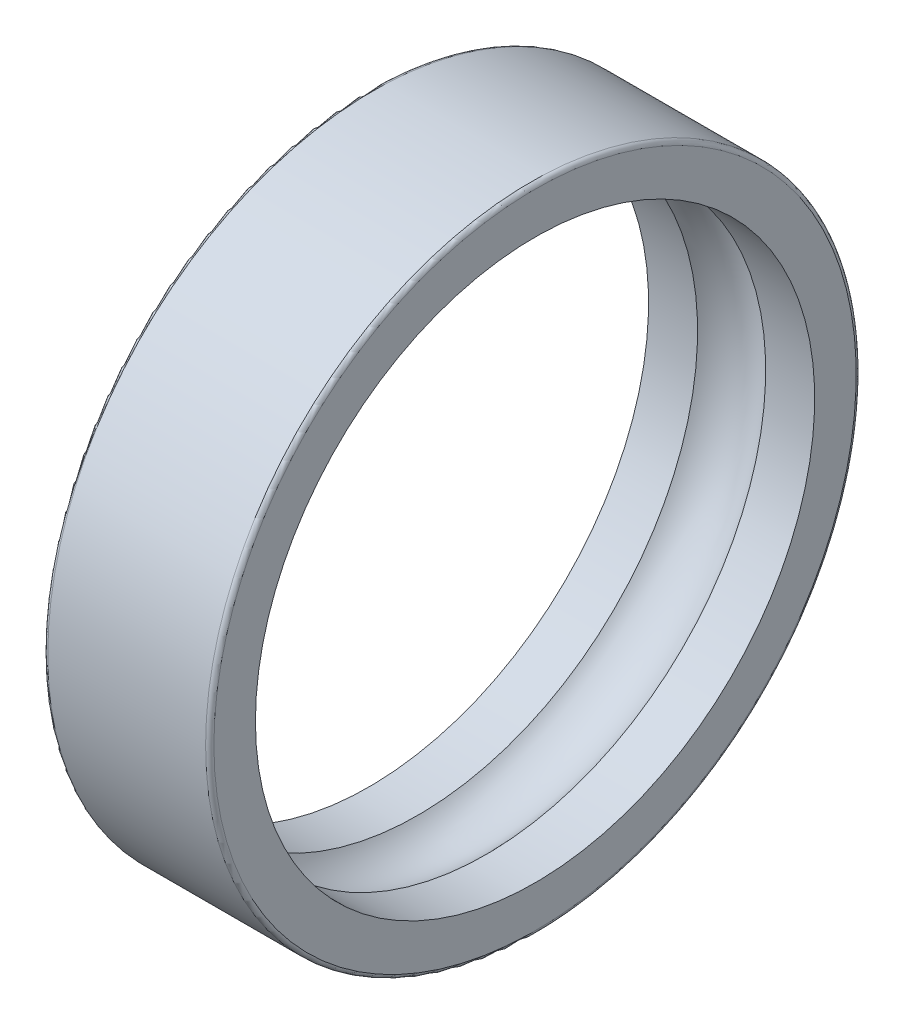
ISO-10303-21;
HEADER;
FILE_DESCRIPTION(('STEP AP214'),'2;1');
FILE_NAME('part.step','',(''),(''),'','','');
FILE_SCHEMA(('AUTOMOTIVE_DESIGN { 1 0 10303 214 1 1 1 1 }'));
ENDSEC;
DATA;
#1=APPLICATION_CONTEXT('core data for automotive mechanical design processes');
#2=APPLICATION_PROTOCOL_DEFINITION('international standard','automotive_design',2000,#1);
#3=PRODUCT_CONTEXT('',#1,'mechanical');
#4=PRODUCT('Part','Part','',(#3));
#5=PRODUCT_RELATED_PRODUCT_CATEGORY('part','',(#4));
#6=PRODUCT_DEFINITION_FORMATION('','',#4);
#7=PRODUCT_DEFINITION_CONTEXT('part definition',#1,'design');
#8=PRODUCT_DEFINITION('design','',#6,#7);
#9=PRODUCT_DEFINITION_SHAPE('','',#8);
#10=(LENGTH_UNIT() NAMED_UNIT(*) SI_UNIT(.MILLI.,.METRE.));
#11=(NAMED_UNIT(*) PLANE_ANGLE_UNIT() SI_UNIT($,.RADIAN.));
#12=(NAMED_UNIT(*) SI_UNIT($,.STERADIAN.) SOLID_ANGLE_UNIT());
#13=UNCERTAINTY_MEASURE_WITH_UNIT(LENGTH_MEASURE(1.E-05),#10,'distance_accuracy_value','');
#14=(GEOMETRIC_REPRESENTATION_CONTEXT(3) GLOBAL_UNCERTAINTY_ASSIGNED_CONTEXT((#13)) GLOBAL_UNIT_ASSIGNED_CONTEXT((#10,
#11,#12)) REPRESENTATION_CONTEXT('',''));
#15=CARTESIAN_POINT('',(0.,0.,0.));
#16=DIRECTION('',(0.,0.,1.));
#17=DIRECTION('',(1.,0.,0.));
#18=AXIS2_PLACEMENT_3D('',#15,#16,#17);
#19=CARTESIAN_POINT('',(0.299999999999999,0.,0.));
#20=DIRECTION('',(-1.,0.,0.));
#21=DIRECTION('',(0.,0.,1.));
#22=AXIS2_PLACEMENT_3D('',#19,#20,#21);
#23=TOROIDAL_SURFACE('',#22,23.2,0.300000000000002);
#24=CARTESIAN_POINT('',(0.,0.,0.));
#25=DIRECTION('',(-1.,0.,0.));
#26=DIRECTION('',(0.,0.,1.));
#27=AXIS2_PLACEMENT_3D('',#24,#25,#26);
#28=CIRCLE('',#27,23.2);
#29=CARTESIAN_POINT('',(0.,0.,23.2));
#30=VERTEX_POINT('',#29);
#31=EDGE_CURVE('E10',#30,#30,#28,.T.);
#32=ORIENTED_EDGE('',*,*,#31,.F.);
#33=EDGE_LOOP('',(#32));
#34=FACE_BOUND('',#33,.T.);
#35=CARTESIAN_POINT('',(0.299999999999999,0.,0.));
#36=DIRECTION('',(-1.,0.,0.));
#37=DIRECTION('',(0.,0.,1.));
#38=AXIS2_PLACEMENT_3D('',#35,#36,#37);
#39=CIRCLE('',#38,23.5);
#40=CARTESIAN_POINT('',(0.299999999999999,0.,23.5));
#41=VERTEX_POINT('',#40);
#42=EDGE_CURVE('E66',#41,#41,#39,.T.);
#43=ORIENTED_EDGE('',*,*,#42,.T.);
#44=EDGE_LOOP('',(#43));
#45=FACE_BOUND('',#44,.T.);
#46=ADVANCED_FACE('F38',(#34,#45),#23,.T.);
#47=CARTESIAN_POINT('',(0.,0.,-23.2));
#48=DIRECTION('',(1.,0.,0.));
#49=DIRECTION('',(0.,0.,-1.));
#50=AXIS2_PLACEMENT_3D('',#47,#48,#49);
#51=PLANE('',#50);
#52=CARTESIAN_POINT('',(0.,0.,0.));
#53=DIRECTION('',(-1.,0.,0.));
#54=DIRECTION('',(0.,0.,1.));
#55=AXIS2_PLACEMENT_3D('',#52,#53,#54);
#56=CIRCLE('',#55,20.2);
#57=CARTESIAN_POINT('',(0.,0.,20.2));
#58=VERTEX_POINT('',#57);
#59=EDGE_CURVE('E44',#58,#58,#56,.T.);
#60=ORIENTED_EDGE('',*,*,#59,.F.);
#61=EDGE_LOOP('',(#60));
#62=FACE_BOUND('',#61,.T.);
#63=ORIENTED_EDGE('',*,*,#31,.T.);
#64=EDGE_LOOP('',(#63));
#65=FACE_BOUND('',#64,.T.);
#66=ADVANCED_FACE('F103',(#62,#65),#51,.F.);
#67=CARTESIAN_POINT('',(0.,0.,0.));
#68=DIRECTION('',(-1.,0.,0.));
#69=DIRECTION('',(0.,0.,1.));
#70=AXIS2_PLACEMENT_3D('',#67,#68,#69);
#71=CYLINDRICAL_SURFACE('',#70,20.2);
#72=CARTESIAN_POINT('',(3.54032522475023,0.,0.));
#73=DIRECTION('',(-1.,0.,0.));
#74=DIRECTION('',(0.,0.,1.));
#75=AXIS2_PLACEMENT_3D('',#72,#73,#74);
#76=CIRCLE('',#75,20.2);
#77=CARTESIAN_POINT('',(3.54032522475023,0.,20.2));
#78=VERTEX_POINT('',#77);
#79=EDGE_CURVE('E48',#78,#78,#76,.T.);
#80=ORIENTED_EDGE('',*,*,#79,.F.);
#81=EDGE_LOOP('',(#80));
#82=FACE_BOUND('',#81,.T.);
#83=ORIENTED_EDGE('',*,*,#59,.T.);
#84=EDGE_LOOP('',(#83));
#85=FACE_BOUND('',#84,.T.);
#86=ADVANCED_FACE('F98',(#82,#85),#71,.F.);
#87=CARTESIAN_POINT('',(6.,0.,0.));
#88=DIRECTION('',(-1.,0.,0.));
#89=DIRECTION('',(0.,0.,1.));
#90=AXIS2_PLACEMENT_3D('',#87,#88,#89);
#91=TOROIDAL_SURFACE('',#90,18.,3.3);
#92=CARTESIAN_POINT('',(8.45967477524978,0.,0.));
#93=DIRECTION('',(-1.,0.,0.));
#94=DIRECTION('',(0.,0.,1.));
#95=AXIS2_PLACEMENT_3D('',#92,#93,#94);
#96=CIRCLE('',#95,20.2);
#97=CARTESIAN_POINT('',(8.45967477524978,0.,20.2));
#98=VERTEX_POINT('',#97);
#99=EDGE_CURVE('E52',#98,#98,#96,.T.);
#100=ORIENTED_EDGE('',*,*,#99,.F.);
#101=EDGE_LOOP('',(#100));
#102=FACE_BOUND('',#101,.T.);
#103=ORIENTED_EDGE('',*,*,#79,.T.);
#104=EDGE_LOOP('',(#103));
#105=FACE_BOUND('',#104,.T.);
#106=ADVANCED_FACE('F92',(#102,#105),#91,.F.);
#107=CARTESIAN_POINT('',(0.,0.,0.));
#108=DIRECTION('',(-1.,0.,0.));
#109=DIRECTION('',(0.,0.,1.));
#110=AXIS2_PLACEMENT_3D('',#107,#108,#109);
#111=CYLINDRICAL_SURFACE('',#110,20.2);
#112=CARTESIAN_POINT('',(12.,0.,0.));
#113=DIRECTION('',(-1.,0.,0.));
#114=DIRECTION('',(0.,0.,1.));
#115=AXIS2_PLACEMENT_3D('',#112,#113,#114);
#116=CIRCLE('',#115,20.2);
#117=CARTESIAN_POINT('',(12.,0.,20.2));
#118=VERTEX_POINT('',#117);
#119=EDGE_CURVE('E57',#118,#118,#116,.T.);
#120=ORIENTED_EDGE('',*,*,#119,.F.);
#121=EDGE_LOOP('',(#120));
#122=FACE_BOUND('',#121,.T.);
#123=ORIENTED_EDGE('',*,*,#99,.T.);
#124=EDGE_LOOP('',(#123));
#125=FACE_BOUND('',#124,.T.);
#126=ADVANCED_FACE('F86',(#122,#125),#111,.F.);
#127=CARTESIAN_POINT('',(12.,0.,-23.2));
#128=DIRECTION('',(-1.,0.,0.));
#129=DIRECTION('',(0.,0.,1.));
#130=AXIS2_PLACEMENT_3D('',#127,#128,#129);
#131=PLANE('',#130);
#132=CARTESIAN_POINT('',(12.,0.,0.));
#133=DIRECTION('',(-1.,0.,0.));
#134=DIRECTION('',(0.,0.,1.));
#135=AXIS2_PLACEMENT_3D('',#132,#133,#134);
#136=CIRCLE('',#135,23.2);
#137=CARTESIAN_POINT('',(12.,0.,23.2));
#138=VERTEX_POINT('',#137);
#139=EDGE_CURVE('E60',#138,#138,#136,.T.);
#140=ORIENTED_EDGE('',*,*,#139,.F.);
#141=EDGE_LOOP('',(#140));
#142=FACE_BOUND('',#141,.T.);
#143=ORIENTED_EDGE('',*,*,#119,.T.);
#144=EDGE_LOOP('',(#143));
#145=FACE_BOUND('',#144,.T.);
#146=ADVANCED_FACE('F80',(#142,#145),#131,.F.);
#147=CARTESIAN_POINT('',(11.7,0.,0.));
#148=DIRECTION('',(-1.,0.,0.));
#149=DIRECTION('',(0.,0.,1.));
#150=AXIS2_PLACEMENT_3D('',#147,#148,#149);
#151=TOROIDAL_SURFACE('',#150,23.2,0.300000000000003);
#152=CARTESIAN_POINT('',(11.7,0.,0.));
#153=DIRECTION('',(-1.,0.,0.));
#154=DIRECTION('',(0.,0.,1.));
#155=AXIS2_PLACEMENT_3D('',#152,#153,#154);
#156=CIRCLE('',#155,23.5);
#157=CARTESIAN_POINT('',(11.7,0.,23.5));
#158=VERTEX_POINT('',#157);
#159=EDGE_CURVE('E63',#158,#158,#156,.T.);
#160=ORIENTED_EDGE('',*,*,#159,.F.);
#161=EDGE_LOOP('',(#160));
#162=FACE_BOUND('',#161,.T.);
#163=ORIENTED_EDGE('',*,*,#139,.T.);
#164=EDGE_LOOP('',(#163));
#165=FACE_BOUND('',#164,.T.);
#166=ADVANCED_FACE('F74',(#162,#165),#151,.T.);
#167=CARTESIAN_POINT('',(0.,0.,0.));
#168=DIRECTION('',(-1.,0.,0.));
#169=DIRECTION('',(0.,0.,1.));
#170=AXIS2_PLACEMENT_3D('',#167,#168,#169);
#171=CYLINDRICAL_SURFACE('',#170,23.5);
#172=ORIENTED_EDGE('',*,*,#42,.F.);
#173=EDGE_LOOP('',(#172));
#174=FACE_BOUND('',#173,.T.);
#175=ORIENTED_EDGE('',*,*,#159,.T.);
#176=EDGE_LOOP('',(#175));
#177=FACE_BOUND('',#176,.T.);
#178=ADVANCED_FACE('F71',(#174,#177),#171,.T.);
#179=CLOSED_SHELL('',(#46,#66,#86,#106,#126,#146,#166,#178));
#180=MANIFOLD_SOLID_BREP('B2',#179);
#181=ADVANCED_BREP_SHAPE_REPRESENTATION('',(#18,#180),#14);
#182=SHAPE_DEFINITION_REPRESENTATION(#9,#181);
ENDSEC;
END-ISO-10303-21;
